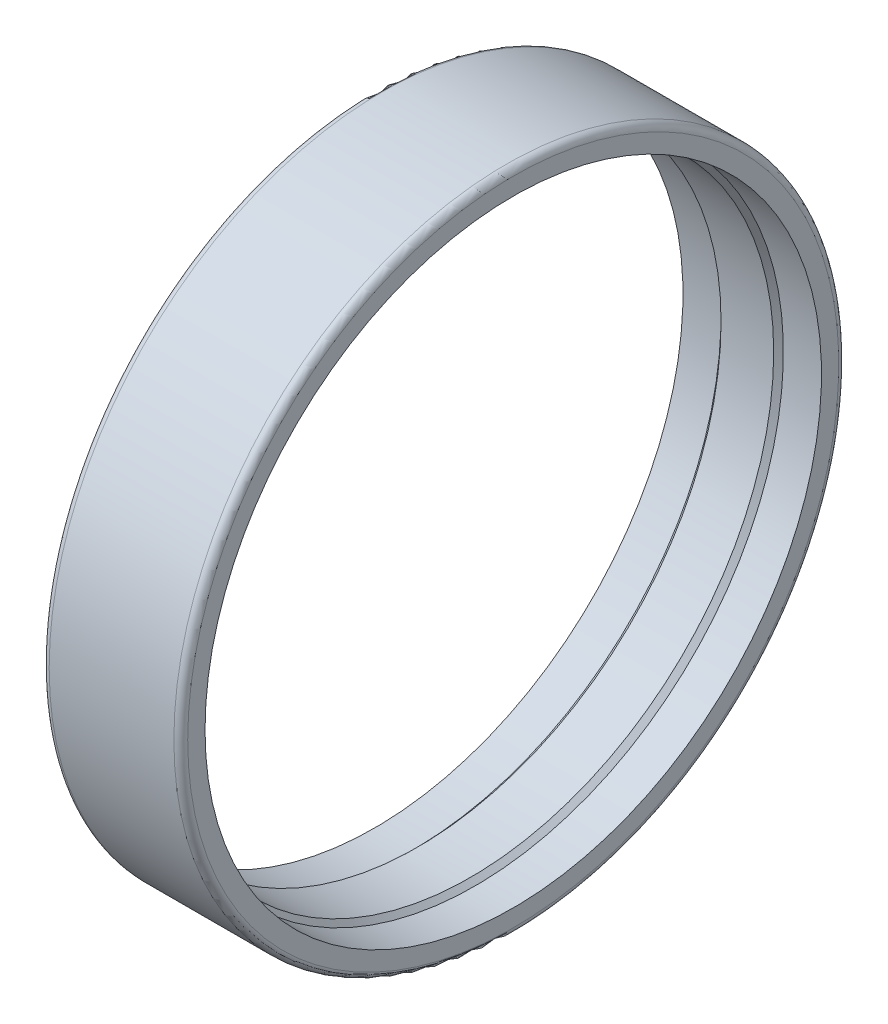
ISO-10303-21;
HEADER;
FILE_DESCRIPTION(('STEP AP214'),'2;1');
FILE_NAME('part.step','',(''),(''),'','','');
FILE_SCHEMA(('AUTOMOTIVE_DESIGN { 1 0 10303 214 1 1 1 1 }'));
ENDSEC;
DATA;
#1=APPLICATION_CONTEXT('core data for automotive mechanical design processes');
#2=APPLICATION_PROTOCOL_DEFINITION('international standard','automotive_design',2000,#1);
#3=PRODUCT_CONTEXT('',#1,'mechanical');
#4=PRODUCT('Part','Part','',(#3));
#5=PRODUCT_RELATED_PRODUCT_CATEGORY('part','',(#4));
#6=PRODUCT_DEFINITION_FORMATION('','',#4);
#7=PRODUCT_DEFINITION_CONTEXT('part definition',#1,'design');
#8=PRODUCT_DEFINITION('design','',#6,#7);
#9=PRODUCT_DEFINITION_SHAPE('','',#8);
#10=(LENGTH_UNIT() NAMED_UNIT(*) SI_UNIT(.MILLI.,.METRE.));
#11=(NAMED_UNIT(*) PLANE_ANGLE_UNIT() SI_UNIT($,.RADIAN.));
#12=(NAMED_UNIT(*) SI_UNIT($,.STERADIAN.) SOLID_ANGLE_UNIT());
#13=UNCERTAINTY_MEASURE_WITH_UNIT(LENGTH_MEASURE(1.E-05),#10,'distance_accuracy_value','');
#14=(GEOMETRIC_REPRESENTATION_CONTEXT(3) GLOBAL_UNCERTAINTY_ASSIGNED_CONTEXT((#13)) GLOBAL_UNIT_ASSIGNED_CONTEXT((#10,
#11,#12)) REPRESENTATION_CONTEXT('',''));
#15=CARTESIAN_POINT('',(0.,0.,0.));
#16=DIRECTION('',(0.,0.,1.));
#17=DIRECTION('',(1.,0.,0.));
#18=AXIS2_PLACEMENT_3D('',#15,#16,#17);
#19=CARTESIAN_POINT('',(0.,0.,0.));
#20=DIRECTION('',(-1.,0.,0.));
#21=DIRECTION('',(0.,0.,1.));
#22=AXIS2_PLACEMENT_3D('',#19,#20,#21);
#23=CYLINDRICAL_SURFACE('',#22,43.8);
#24=CARTESIAN_POINT('',(3.80000000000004,0.,0.));
#25=DIRECTION('',(-1.,0.,0.));
#26=DIRECTION('',(0.,0.,1.));
#27=AXIS2_PLACEMENT_3D('',#24,#25,#26);
#28=CIRCLE('',#27,43.8);
#29=CARTESIAN_POINT('',(3.80000000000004,0.,43.8));
#30=VERTEX_POINT('',#29);
#31=EDGE_CURVE('E58',#30,#30,#28,.F.);
#32=ORIENTED_EDGE('',*,*,#31,.T.);
#33=EDGE_LOOP('',(#32));
#34=FACE_BOUND('',#33,.T.);
#35=CARTESIAN_POINT('',(-3.79999999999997,0.,0.));
#36=DIRECTION('',(1.,0.,0.));
#37=DIRECTION('',(0.,0.,-1.));
#38=AXIS2_PLACEMENT_3D('',#35,#36,#37);
#39=CIRCLE('',#38,43.8);
#40=CARTESIAN_POINT('',(-3.79999999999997,0.,-43.8));
#41=VERTEX_POINT('',#40);
#42=EDGE_CURVE('E61',#41,#41,#39,.F.);
#43=ORIENTED_EDGE('',*,*,#42,.T.);
#44=EDGE_LOOP('',(#43));
#45=FACE_BOUND('',#44,.T.);
#46=ADVANCED_FACE('F38',(#34,#45),#23,.F.);
#47=CARTESIAN_POINT('',(0.,0.,0.));
#48=DIRECTION('',(-1.,0.,0.));
#49=DIRECTION('',(0.,0.,1.));
#50=AXIS2_PLACEMENT_3D('',#47,#48,#49);
#51=CYLINDRICAL_SURFACE('',#50,44.5);
#52=CARTESIAN_POINT('',(10.,0.,0.));
#53=DIRECTION('',(-1.,0.,0.));
#54=DIRECTION('',(0.,0.,1.));
#55=AXIS2_PLACEMENT_3D('',#52,#53,#54);
#56=CIRCLE('',#55,44.5);
#57=CARTESIAN_POINT('',(10.,0.,44.5));
#58=VERTEX_POINT('',#57);
#59=EDGE_CURVE('E67',#58,#58,#56,.T.);
#60=ORIENTED_EDGE('',*,*,#59,.F.);
#61=EDGE_LOOP('',(#60));
#62=FACE_BOUND('',#61,.T.);
#63=CARTESIAN_POINT('',(4.5,0.,0.));
#64=DIRECTION('',(-1.,0.,0.));
#65=DIRECTION('',(0.,0.,1.));
#66=AXIS2_PLACEMENT_3D('',#63,#64,#65);
#67=CIRCLE('',#66,44.5);
#68=CARTESIAN_POINT('',(4.5,0.,44.5));
#69=VERTEX_POINT('',#68);
#70=EDGE_CURVE('E64',#69,#69,#67,.T.);
#71=ORIENTED_EDGE('',*,*,#70,.T.);
#72=EDGE_LOOP('',(#71));
#73=FACE_BOUND('',#72,.T.);
#74=ADVANCED_FACE('F97',(#62,#73),#51,.F.);
#75=CARTESIAN_POINT('',(10.,44.5,0.));
#76=DIRECTION('',(-1.,0.,0.));
#77=DIRECTION('',(0.,0.,1.));
#78=AXIS2_PLACEMENT_3D('',#75,#76,#77);
#79=PLANE('',#78);
#80=CARTESIAN_POINT('',(10.,0.,0.));
#81=DIRECTION('',(-1.,0.,0.));
#82=DIRECTION('',(0.,0.,1.));
#83=AXIS2_PLACEMENT_3D('',#80,#81,#82);
#84=CIRCLE('',#83,47.);
#85=CARTESIAN_POINT('',(10.,0.,47.));
#86=VERTEX_POINT('',#85);
#87=EDGE_CURVE('E10',#86,#86,#84,.F.);
#88=ORIENTED_EDGE('',*,*,#87,.T.);
#89=EDGE_LOOP('',(#88));
#90=FACE_BOUND('',#89,.T.);
#91=ORIENTED_EDGE('',*,*,#59,.T.);
#92=EDGE_LOOP('',(#91));
#93=FACE_BOUND('',#92,.T.);
#94=ADVANCED_FACE('F94',(#90,#93),#79,.F.);
#95=CARTESIAN_POINT('',(0.,0.,0.));
#96=DIRECTION('',(-1.,0.,0.));
#97=DIRECTION('',(0.,0.,1.));
#98=AXIS2_PLACEMENT_3D('',#95,#96,#97);
#99=CYLINDRICAL_SURFACE('',#98,48.);
#100=CARTESIAN_POINT('',(-9.,0.,0.));
#101=DIRECTION('',(1.,0.,0.));
#102=DIRECTION('',(0.,0.,-1.));
#103=AXIS2_PLACEMENT_3D('',#100,#101,#102);
#104=CIRCLE('',#103,48.);
#105=CARTESIAN_POINT('',(-9.,0.,-48.));
#106=VERTEX_POINT('',#105);
#107=EDGE_CURVE('E45',#106,#106,#104,.T.);
#108=ORIENTED_EDGE('',*,*,#107,.T.);
#109=EDGE_LOOP('',(#108));
#110=FACE_BOUND('',#109,.T.);
#111=CARTESIAN_POINT('',(9.,0.,0.));
#112=DIRECTION('',(-1.,0.,0.));
#113=DIRECTION('',(0.,0.,1.));
#114=AXIS2_PLACEMENT_3D('',#111,#112,#113);
#115=CIRCLE('',#114,48.);
#116=CARTESIAN_POINT('',(9.,0.,48.));
#117=VERTEX_POINT('',#116);
#118=EDGE_CURVE('E49',#117,#117,#115,.T.);
#119=ORIENTED_EDGE('',*,*,#118,.T.);
#120=EDGE_LOOP('',(#119));
#121=FACE_BOUND('',#120,.T.);
#122=ADVANCED_FACE('F88',(#110,#121),#99,.T.);
#123=CARTESIAN_POINT('',(-10.,48.,0.));
#124=DIRECTION('',(1.,0.,0.));
#125=DIRECTION('',(0.,0.,-1.));
#126=AXIS2_PLACEMENT_3D('',#123,#124,#125);
#127=PLANE('',#126);
#128=CARTESIAN_POINT('',(-10.,0.,0.));
#129=DIRECTION('',(1.,0.,0.));
#130=DIRECTION('',(0.,0.,-1.));
#131=AXIS2_PLACEMENT_3D('',#128,#129,#130);
#132=CIRCLE('',#131,47.);
#133=CARTESIAN_POINT('',(-10.,0.,-47.));
#134=VERTEX_POINT('',#133);
#135=EDGE_CURVE('E53',#134,#134,#132,.F.);
#136=ORIENTED_EDGE('',*,*,#135,.T.);
#137=EDGE_LOOP('',(#136));
#138=FACE_BOUND('',#137,.T.);
#139=CARTESIAN_POINT('',(-10.,0.,0.));
#140=DIRECTION('',(-1.,0.,0.));
#141=DIRECTION('',(0.,0.,1.));
#142=AXIS2_PLACEMENT_3D('',#139,#140,#141);
#143=CIRCLE('',#142,44.5);
#144=CARTESIAN_POINT('',(-10.,0.,44.5));
#145=VERTEX_POINT('',#144);
#146=EDGE_CURVE('E70',#145,#145,#143,.T.);
#147=ORIENTED_EDGE('',*,*,#146,.F.);
#148=EDGE_LOOP('',(#147));
#149=FACE_BOUND('',#148,.T.);
#150=ADVANCED_FACE('F83',(#138,#149),#127,.F.);
#151=CARTESIAN_POINT('',(0.,0.,0.));
#152=DIRECTION('',(-1.,0.,0.));
#153=DIRECTION('',(0.,0.,1.));
#154=AXIS2_PLACEMENT_3D('',#151,#152,#153);
#155=CYLINDRICAL_SURFACE('',#154,44.5);
#156=CARTESIAN_POINT('',(-4.5,0.,0.));
#157=DIRECTION('',(-1.,0.,0.));
#158=DIRECTION('',(0.,0.,1.));
#159=AXIS2_PLACEMENT_3D('',#156,#157,#158);
#160=CIRCLE('',#159,44.5);
#161=CARTESIAN_POINT('',(-4.5,0.,44.5));
#162=VERTEX_POINT('',#161);
#163=EDGE_CURVE('E73',#162,#162,#160,.T.);
#164=ORIENTED_EDGE('',*,*,#163,.F.);
#165=EDGE_LOOP('',(#164));
#166=FACE_BOUND('',#165,.T.);
#167=ORIENTED_EDGE('',*,*,#146,.T.);
#168=EDGE_LOOP('',(#167));
#169=FACE_BOUND('',#168,.T.);
#170=ADVANCED_FACE('F80',(#166,#169),#155,.F.);
#171=CARTESIAN_POINT('',(-3.79999999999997,0.,0.));
#172=DIRECTION('',(-1.,0.,0.));
#173=DIRECTION('',(0.,0.,1.));
#174=AXIS2_PLACEMENT_3D('',#171,#172,#173);
#175=CONICAL_SURFACE('',#174,43.8,0.785398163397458);
#176=ORIENTED_EDGE('',*,*,#163,.T.);
#177=EDGE_LOOP('',(#176));
#178=FACE_BOUND('',#177,.T.);
#179=ORIENTED_EDGE('',*,*,#42,.F.);
#180=EDGE_LOOP('',(#179));
#181=FACE_BOUND('',#180,.T.);
#182=ADVANCED_FACE('F77',(#178,#181),#175,.F.);
#183=CARTESIAN_POINT('',(4.5,0.,0.));
#184=DIRECTION('',(1.,0.,0.));
#185=DIRECTION('',(0.,0.,-1.));
#186=AXIS2_PLACEMENT_3D('',#183,#184,#185);
#187=CONICAL_SURFACE('',#186,44.5,0.785398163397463);
#188=ORIENTED_EDGE('',*,*,#31,.F.);
#189=EDGE_LOOP('',(#188));
#190=FACE_BOUND('',#189,.T.);
#191=ORIENTED_EDGE('',*,*,#70,.F.);
#192=EDGE_LOOP('',(#191));
#193=FACE_BOUND('',#192,.T.);
#194=ADVANCED_FACE('F114',(#190,#193),#187,.F.);
#195=CARTESIAN_POINT('',(-9.,0.,0.));
#196=DIRECTION('',(1.,0.,0.));
#197=DIRECTION('',(0.,0.,-1.));
#198=AXIS2_PLACEMENT_3D('',#195,#196,#197);
#199=TOROIDAL_SURFACE('',#198,47.,1.);
#200=ORIENTED_EDGE('',*,*,#107,.F.);
#201=EDGE_LOOP('',(#200));
#202=FACE_BOUND('',#201,.T.);
#203=ORIENTED_EDGE('',*,*,#135,.F.);
#204=EDGE_LOOP('',(#203));
#205=FACE_BOUND('',#204,.T.);
#206=ADVANCED_FACE('F118',(#202,#205),#199,.T.);
#207=CARTESIAN_POINT('',(9.,0.,0.));
#208=DIRECTION('',(-1.,0.,0.));
#209=DIRECTION('',(0.,0.,1.));
#210=AXIS2_PLACEMENT_3D('',#207,#208,#209);
#211=TOROIDAL_SURFACE('',#210,47.,1.);
#212=ORIENTED_EDGE('',*,*,#87,.F.);
#213=EDGE_LOOP('',(#212));
#214=FACE_BOUND('',#213,.T.);
#215=ORIENTED_EDGE('',*,*,#118,.F.);
#216=EDGE_LOOP('',(#215));
#217=FACE_BOUND('',#216,.T.);
#218=ADVANCED_FACE('F40',(#214,#217),#211,.T.);
#219=CLOSED_SHELL('',(#46,#74,#94,#122,#150,#170,#182,#194,#206,#218));
#220=MANIFOLD_SOLID_BREP('B2',#219);
#221=ADVANCED_BREP_SHAPE_REPRESENTATION('',(#18,#220),#14);
#222=SHAPE_DEFINITION_REPRESENTATION(#9,#221);
ENDSEC;
END-ISO-10303-21;
